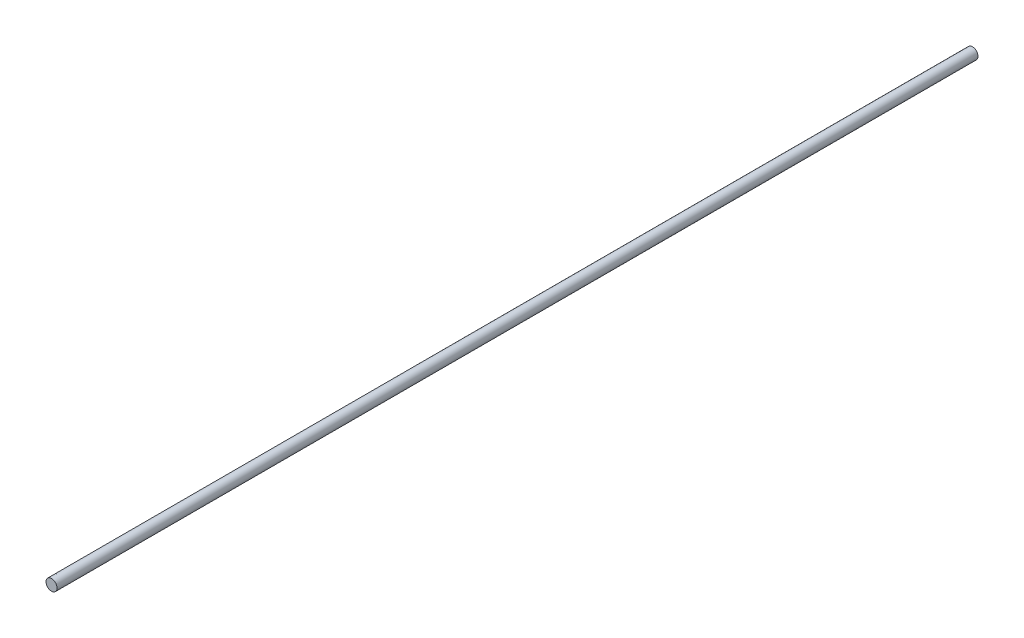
ISO-10303-21;
HEADER;
FILE_DESCRIPTION(('STEP AP214'),'2;1');
FILE_NAME('part.step','',(''),(''),'','','');
FILE_SCHEMA(('AUTOMOTIVE_DESIGN { 1 0 10303 214 1 1 1 1 }'));
ENDSEC;
DATA;
#1=APPLICATION_CONTEXT('core data for automotive mechanical design processes');
#2=APPLICATION_PROTOCOL_DEFINITION('international standard','automotive_design',2000,#1);
#3=PRODUCT_CONTEXT('',#1,'mechanical');
#4=PRODUCT('Part','Part','',(#3));
#5=PRODUCT_RELATED_PRODUCT_CATEGORY('part','',(#4));
#6=PRODUCT_DEFINITION_FORMATION('','',#4);
#7=PRODUCT_DEFINITION_CONTEXT('part definition',#1,'design');
#8=PRODUCT_DEFINITION('design','',#6,#7);
#9=PRODUCT_DEFINITION_SHAPE('','',#8);
#10=(LENGTH_UNIT() NAMED_UNIT(*) SI_UNIT(.MILLI.,.METRE.));
#11=(NAMED_UNIT(*) PLANE_ANGLE_UNIT() SI_UNIT($,.RADIAN.));
#12=(NAMED_UNIT(*) SI_UNIT($,.STERADIAN.) SOLID_ANGLE_UNIT());
#13=UNCERTAINTY_MEASURE_WITH_UNIT(LENGTH_MEASURE(1.E-05),#10,'distance_accuracy_value','');
#14=(GEOMETRIC_REPRESENTATION_CONTEXT(3) GLOBAL_UNCERTAINTY_ASSIGNED_CONTEXT((#13)) GLOBAL_UNIT_ASSIGNED_CONTEXT((#10,
#11,#12)) REPRESENTATION_CONTEXT('',''));
#15=CARTESIAN_POINT('',(0.,0.,0.));
#16=DIRECTION('',(0.,0.,1.));
#17=DIRECTION('',(1.,0.,0.));
#18=AXIS2_PLACEMENT_3D('',#15,#16,#17);
#19=CARTESIAN_POINT('',(0.,0.,250.));
#20=DIRECTION('',(0.,0.,-1.));
#21=DIRECTION('',(-1.,0.,0.));
#22=AXIS2_PLACEMENT_3D('',#19,#20,#21);
#23=CYLINDRICAL_SURFACE('',#22,1.5);
#24=CARTESIAN_POINT('',(0.,0.,250.));
#25=DIRECTION('',(0.,0.,1.));
#26=DIRECTION('',(1.,0.,0.));
#27=AXIS2_PLACEMENT_3D('',#24,#25,#26);
#28=CIRCLE('',#27,1.5);
#29=CARTESIAN_POINT('',(1.5,0.,250.));
#30=VERTEX_POINT('',#29);
#31=EDGE_CURVE('E10',#30,#30,#28,.T.);
#32=ORIENTED_EDGE('',*,*,#31,.F.);
#33=EDGE_LOOP('',(#32));
#34=FACE_BOUND('',#33,.T.);
#35=CARTESIAN_POINT('',(0.,0.,0.));
#36=DIRECTION('',(0.,0.,1.));
#37=DIRECTION('',(1.,0.,0.));
#38=AXIS2_PLACEMENT_3D('',#35,#36,#37);
#39=CIRCLE('',#38,1.5);
#40=CARTESIAN_POINT('',(1.5,0.,0.));
#41=VERTEX_POINT('',#40);
#42=EDGE_CURVE('E34',#41,#41,#39,.T.);
#43=ORIENTED_EDGE('',*,*,#42,.T.);
#44=EDGE_LOOP('',(#43));
#45=FACE_BOUND('',#44,.T.);
#46=ADVANCED_FACE('F31',(#34,#45),#23,.T.);
#47=CARTESIAN_POINT('',(0.,0.,250.));
#48=DIRECTION('',(0.,0.,1.));
#49=DIRECTION('',(1.,0.,0.));
#50=AXIS2_PLACEMENT_3D('',#47,#48,#49);
#51=PLANE('',#50);
#52=ORIENTED_EDGE('',*,*,#31,.T.);
#53=EDGE_LOOP('',(#52));
#54=FACE_BOUND('',#53,.T.);
#55=ADVANCED_FACE('F46',(#54),#51,.T.);
#56=CARTESIAN_POINT('',(0.,0.,0.));
#57=DIRECTION('',(0.,0.,1.));
#58=DIRECTION('',(1.,0.,0.));
#59=AXIS2_PLACEMENT_3D('',#56,#57,#58);
#60=PLANE('',#59);
#61=ORIENTED_EDGE('',*,*,#42,.F.);
#62=EDGE_LOOP('',(#61));
#63=FACE_BOUND('',#62,.T.);
#64=ADVANCED_FACE('F44',(#63),#60,.F.);
#65=CLOSED_SHELL('',(#46,#55,#64));
#66=MANIFOLD_SOLID_BREP('B2',#65);
#67=ADVANCED_BREP_SHAPE_REPRESENTATION('',(#18,#66),#14);
#68=SHAPE_DEFINITION_REPRESENTATION(#9,#67);
ENDSEC;
END-ISO-10303-21;
